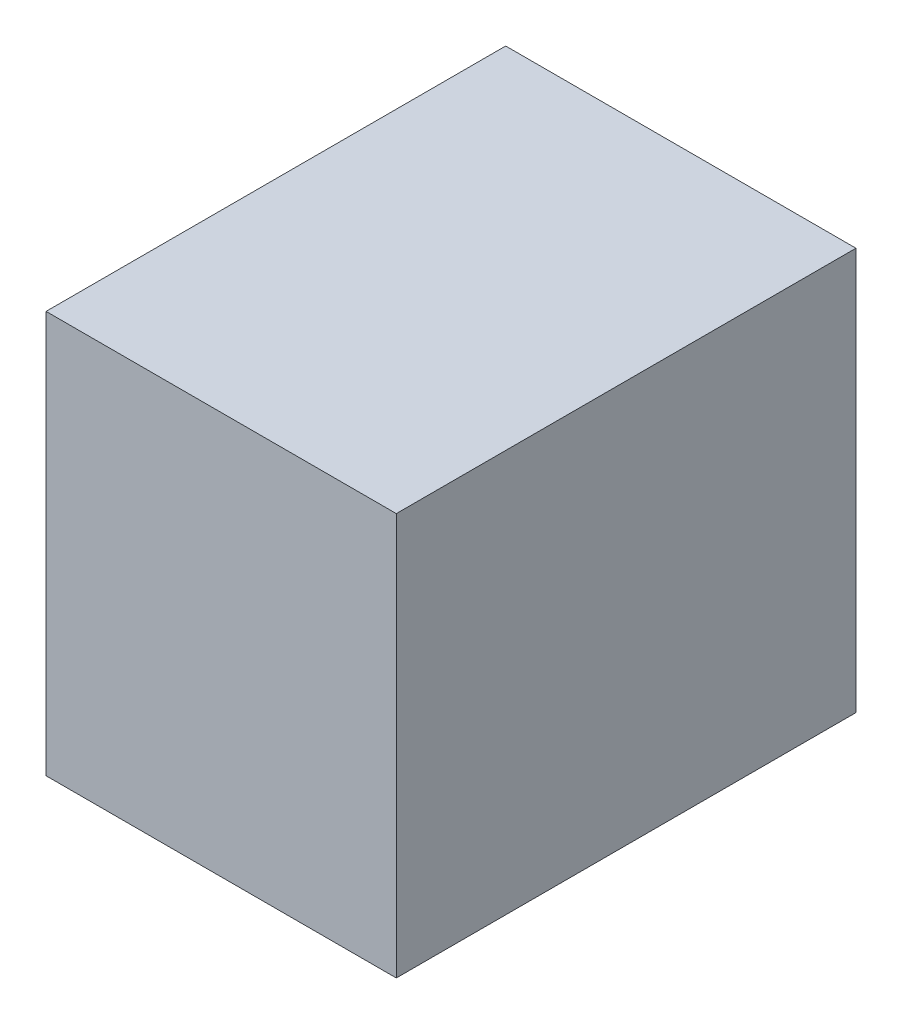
ISO-10303-21;
HEADER;
FILE_DESCRIPTION(('STEP AP214'),'2;1');
FILE_NAME('part.step','',(''),(''),'','','');
FILE_SCHEMA(('AUTOMOTIVE_DESIGN { 1 0 10303 214 1 1 1 1 }'));
ENDSEC;
DATA;
#1=APPLICATION_CONTEXT('core data for automotive mechanical design processes');
#2=APPLICATION_PROTOCOL_DEFINITION('international standard','automotive_design',2000,#1);
#3=PRODUCT_CONTEXT('',#1,'mechanical');
#4=PRODUCT('Part','Part','',(#3));
#5=PRODUCT_RELATED_PRODUCT_CATEGORY('part','',(#4));
#6=PRODUCT_DEFINITION_FORMATION('','',#4);
#7=PRODUCT_DEFINITION_CONTEXT('part definition',#1,'design');
#8=PRODUCT_DEFINITION('design','',#6,#7);
#9=PRODUCT_DEFINITION_SHAPE('','',#8);
#10=(LENGTH_UNIT() NAMED_UNIT(*) SI_UNIT(.MILLI.,.METRE.));
#11=(NAMED_UNIT(*) PLANE_ANGLE_UNIT() SI_UNIT($,.RADIAN.));
#12=(NAMED_UNIT(*) SI_UNIT($,.STERADIAN.) SOLID_ANGLE_UNIT());
#13=UNCERTAINTY_MEASURE_WITH_UNIT(LENGTH_MEASURE(1.E-05),#10,'distance_accuracy_value','');
#14=(GEOMETRIC_REPRESENTATION_CONTEXT(3) GLOBAL_UNCERTAINTY_ASSIGNED_CONTEXT((#13)) GLOBAL_UNIT_ASSIGNED_CONTEXT((#10,
#11,#12)) REPRESENTATION_CONTEXT('',''));
#15=CARTESIAN_POINT('',(0.,0.,0.));
#16=DIRECTION('',(0.,0.,1.));
#17=DIRECTION('',(1.,0.,0.));
#18=AXIS2_PLACEMENT_3D('',#15,#16,#17);
#19=CARTESIAN_POINT('',(0.,0.,1.00000054));
#20=DIRECTION('',(0.,0.,1.));
#21=DIRECTION('',(1.,0.,0.));
#22=AXIS2_PLACEMENT_3D('',#19,#20,#21);
#23=PLANE('',#22);
#24=DIRECTION('',(1.,0.,0.));
#25=VECTOR('',#24,1.);
#26=CARTESIAN_POINT('',(-0.381,-0.43749976,1.00000054));
#27=LINE('',#26,#25);
#28=CARTESIAN_POINT('',(-0.381,-0.43749976,1.00000054));
#29=VERTEX_POINT('',#28);
#30=CARTESIAN_POINT('',(0.381,-0.43749976,1.00000054));
#31=VERTEX_POINT('',#30);
#32=EDGE_CURVE('E70',#29,#31,#27,.T.);
#33=ORIENTED_EDGE('',*,*,#32,.T.);
#34=DIRECTION('',(0.,1.,0.));
#35=VECTOR('',#34,1.);
#36=CARTESIAN_POINT('',(0.381,-0.43749976,1.00000054));
#37=LINE('',#36,#35);
#38=CARTESIAN_POINT('',(0.381,0.43749976,1.00000054));
#39=VERTEX_POINT('',#38);
#40=EDGE_CURVE('E102',#31,#39,#37,.T.);
#41=ORIENTED_EDGE('',*,*,#40,.T.);
#42=DIRECTION('',(-1.,0.,0.));
#43=VECTOR('',#42,1.);
#44=CARTESIAN_POINT('',(0.381,0.43749976,1.00000054));
#45=LINE('',#44,#43);
#46=CARTESIAN_POINT('',(-0.381,0.43749976,1.00000054));
#47=VERTEX_POINT('',#46);
#48=EDGE_CURVE('E72',#39,#47,#45,.T.);
#49=ORIENTED_EDGE('',*,*,#48,.T.);
#50=DIRECTION('',(0.,-1.,0.));
#51=VECTOR('',#50,1.);
#52=CARTESIAN_POINT('',(-0.381,0.43749976,1.00000054));
#53=LINE('',#52,#51);
#54=EDGE_CURVE('E11',#47,#29,#53,.T.);
#55=ORIENTED_EDGE('',*,*,#54,.T.);
#56=EDGE_LOOP('',(#33,#41,#49,#55));
#57=FACE_BOUND('',#56,.T.);
#58=ADVANCED_FACE('F17',(#57),#23,.T.);
#59=CARTESIAN_POINT('',(0.,0.,0.));
#60=DIRECTION('',(0.,0.,1.));
#61=DIRECTION('',(1.,0.,0.));
#62=AXIS2_PLACEMENT_3D('',#59,#60,#61);
#63=PLANE('',#62);
#64=DIRECTION('',(0.,-1.,0.));
#65=VECTOR('',#64,1.);
#66=CARTESIAN_POINT('',(-0.381,0.43749976,0.));
#67=LINE('',#66,#65);
#68=CARTESIAN_POINT('',(-0.381,0.43749976,0.));
#69=VERTEX_POINT('',#68);
#70=CARTESIAN_POINT('',(-0.381,-0.43749976,0.));
#71=VERTEX_POINT('',#70);
#72=EDGE_CURVE('E25',#69,#71,#67,.T.);
#73=ORIENTED_EDGE('',*,*,#72,.F.);
#74=DIRECTION('',(-1.,0.,0.));
#75=VECTOR('',#74,1.);
#76=CARTESIAN_POINT('',(0.381,0.43749976,0.));
#77=LINE('',#76,#75);
#78=CARTESIAN_POINT('',(0.381,0.43749976,0.));
#79=VERTEX_POINT('',#78);
#80=EDGE_CURVE('E105',#79,#69,#77,.T.);
#81=ORIENTED_EDGE('',*,*,#80,.F.);
#82=DIRECTION('',(0.,1.,0.));
#83=VECTOR('',#82,1.);
#84=CARTESIAN_POINT('',(0.381,-0.43749976,0.));
#85=LINE('',#84,#83);
#86=CARTESIAN_POINT('',(0.381,-0.43749976,0.));
#87=VERTEX_POINT('',#86);
#88=EDGE_CURVE('E80',#87,#79,#85,.T.);
#89=ORIENTED_EDGE('',*,*,#88,.F.);
#90=DIRECTION('',(1.,0.,0.));
#91=VECTOR('',#90,1.);
#92=CARTESIAN_POINT('',(-0.381,-0.43749976,0.));
#93=LINE('',#92,#91);
#94=EDGE_CURVE('E91',#71,#87,#93,.T.);
#95=ORIENTED_EDGE('',*,*,#94,.F.);
#96=EDGE_LOOP('',(#73,#81,#89,#95));
#97=FACE_BOUND('',#96,.T.);
#98=ADVANCED_FACE('F152',(#97),#63,.F.);
#99=CARTESIAN_POINT('',(-0.381,0.43749976,0.));
#100=DIRECTION('',(1.,0.,0.));
#101=DIRECTION('',(0.,1.,0.));
#102=AXIS2_PLACEMENT_3D('',#99,#100,#101);
#103=PLANE('',#102);
#104=ORIENTED_EDGE('',*,*,#72,.T.);
#105=DIRECTION('',(0.,0.,1.));
#106=VECTOR('',#105,1.);
#107=CARTESIAN_POINT('',(-0.381,-0.43749976,0.));
#108=LINE('',#107,#106);
#109=EDGE_CURVE('E75',#71,#29,#108,.T.);
#110=ORIENTED_EDGE('',*,*,#109,.T.);
#111=ORIENTED_EDGE('',*,*,#54,.F.);
#112=DIRECTION('',(0.,0.,1.));
#113=VECTOR('',#112,1.);
#114=CARTESIAN_POINT('',(-0.381,0.43749976,0.));
#115=LINE('',#114,#113);
#116=EDGE_CURVE('E108',#69,#47,#115,.T.);
#117=ORIENTED_EDGE('',*,*,#116,.F.);
#118=EDGE_LOOP('',(#104,#110,#111,#117));
#119=FACE_BOUND('',#118,.T.);
#120=ADVANCED_FACE('F76',(#119),#103,.F.);
#121=CARTESIAN_POINT('',(0.381,0.43749976,0.));
#122=DIRECTION('',(0.,-1.,0.));
#123=DIRECTION('',(0.,0.,-1.));
#124=AXIS2_PLACEMENT_3D('',#121,#122,#123);
#125=PLANE('',#124);
#126=ORIENTED_EDGE('',*,*,#80,.T.);
#127=ORIENTED_EDGE('',*,*,#116,.T.);
#128=ORIENTED_EDGE('',*,*,#48,.F.);
#129=DIRECTION('',(0.,0.,1.));
#130=VECTOR('',#129,1.);
#131=CARTESIAN_POINT('',(0.381,0.43749976,0.));
#132=LINE('',#131,#130);
#133=EDGE_CURVE('E98',#79,#39,#132,.T.);
#134=ORIENTED_EDGE('',*,*,#133,.F.);
#135=EDGE_LOOP('',(#126,#127,#128,#134));
#136=FACE_BOUND('',#135,.T.);
#137=ADVANCED_FACE('F157',(#136),#125,.F.);
#138=CARTESIAN_POINT('',(0.381,-0.43749976,0.));
#139=DIRECTION('',(-1.,0.,0.));
#140=DIRECTION('',(0.,0.,1.));
#141=AXIS2_PLACEMENT_3D('',#138,#139,#140);
#142=PLANE('',#141);
#143=ORIENTED_EDGE('',*,*,#88,.T.);
#144=ORIENTED_EDGE('',*,*,#133,.T.);
#145=ORIENTED_EDGE('',*,*,#40,.F.);
#146=DIRECTION('',(0.,0.,1.));
#147=VECTOR('',#146,1.);
#148=CARTESIAN_POINT('',(0.381,-0.43749976,0.));
#149=LINE('',#148,#147);
#150=EDGE_CURVE('E84',#87,#31,#149,.T.);
#151=ORIENTED_EDGE('',*,*,#150,.F.);
#152=EDGE_LOOP('',(#143,#144,#145,#151));
#153=FACE_BOUND('',#152,.T.);
#154=ADVANCED_FACE('F155',(#153),#142,.F.);
#155=CARTESIAN_POINT('',(-0.381,-0.43749976,0.));
#156=DIRECTION('',(0.,1.,0.));
#157=DIRECTION('',(1.,0.,0.));
#158=AXIS2_PLACEMENT_3D('',#155,#156,#157);
#159=PLANE('',#158);
#160=ORIENTED_EDGE('',*,*,#94,.T.);
#161=ORIENTED_EDGE('',*,*,#150,.T.);
#162=ORIENTED_EDGE('',*,*,#32,.F.);
#163=ORIENTED_EDGE('',*,*,#109,.F.);
#164=EDGE_LOOP('',(#160,#161,#162,#163));
#165=FACE_BOUND('',#164,.T.);
#166=ADVANCED_FACE('F82',(#165),#159,.F.);
#167=CLOSED_SHELL('',(#58,#98,#120,#137,#154,#166));
#168=MANIFOLD_SOLID_BREP('B1',#167);
#169=ADVANCED_BREP_SHAPE_REPRESENTATION('',(#18,#168),#14);
#170=SHAPE_DEFINITION_REPRESENTATION(#9,#169);
ENDSEC;
END-ISO-10303-21;
